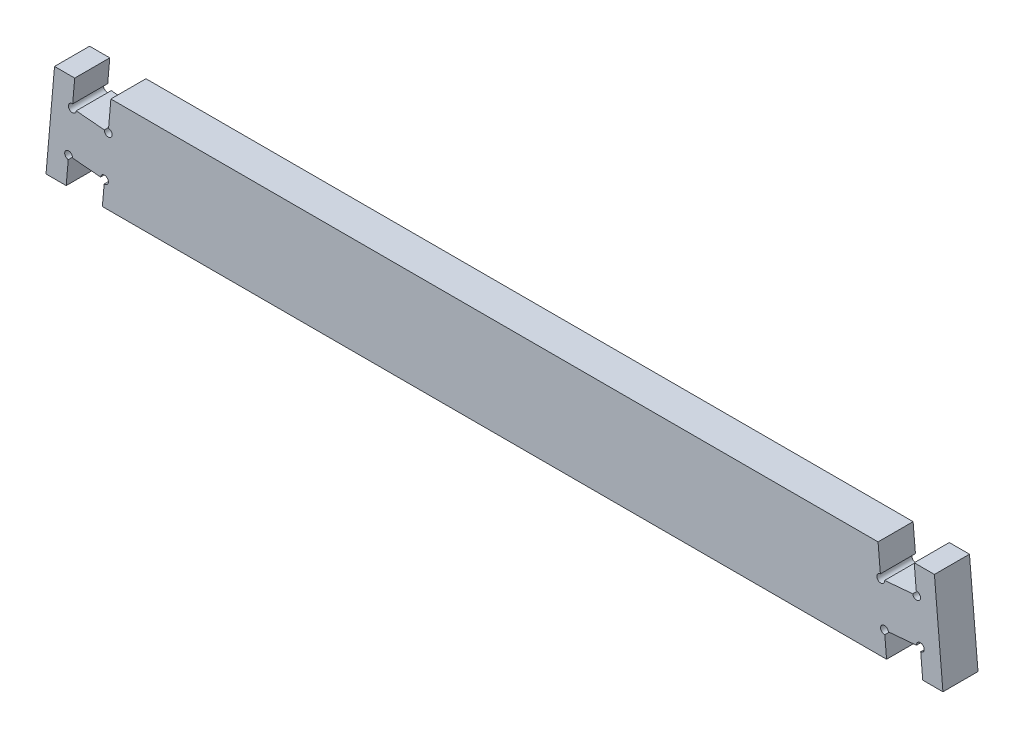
ISO-10303-21;
HEADER;
FILE_DESCRIPTION(('STEP AP214'),'2;1');
FILE_NAME('part.step','',(''),(''),'','','');
FILE_SCHEMA(('AUTOMOTIVE_DESIGN { 1 0 10303 214 1 1 1 1 }'));
ENDSEC;
DATA;
#1=APPLICATION_CONTEXT('core data for automotive mechanical design processes');
#2=APPLICATION_PROTOCOL_DEFINITION('international standard','automotive_design',2000,#1);
#3=PRODUCT_CONTEXT('',#1,'mechanical');
#4=PRODUCT('Part','Part','',(#3));
#5=PRODUCT_RELATED_PRODUCT_CATEGORY('part','',(#4));
#6=PRODUCT_DEFINITION_FORMATION('','',#4);
#7=PRODUCT_DEFINITION_CONTEXT('part definition',#1,'design');
#8=PRODUCT_DEFINITION('design','',#6,#7);
#9=PRODUCT_DEFINITION_SHAPE('','',#8);
#10=(LENGTH_UNIT() NAMED_UNIT(*) SI_UNIT(.MILLI.,.METRE.));
#11=(NAMED_UNIT(*) PLANE_ANGLE_UNIT() SI_UNIT($,.RADIAN.));
#12=(NAMED_UNIT(*) SI_UNIT($,.STERADIAN.) SOLID_ANGLE_UNIT());
#13=UNCERTAINTY_MEASURE_WITH_UNIT(LENGTH_MEASURE(1.E-05),#10,'distance_accuracy_value','');
#14=(GEOMETRIC_REPRESENTATION_CONTEXT(3) GLOBAL_UNCERTAINTY_ASSIGNED_CONTEXT((#13)) GLOBAL_UNIT_ASSIGNED_CONTEXT((#10,
#11,#12)) REPRESENTATION_CONTEXT('',''));
#15=CARTESIAN_POINT('',(0.,0.,0.));
#16=DIRECTION('',(0.,0.,1.));
#17=DIRECTION('',(1.,0.,0.));
#18=AXIS2_PLACEMENT_3D('',#15,#16,#17);
#19=CARTESIAN_POINT('',(-234.662804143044,-276.484369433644,18.));
#20=DIRECTION('',(-0.996194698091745,0.0871557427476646,0.));
#21=DIRECTION('',(-0.0871557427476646,-0.996194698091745,0.));
#22=AXIS2_PLACEMENT_3D('',#19,#20,#21);
#23=PLANE('',#22);
#24=DIRECTION('',(0.0871557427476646,0.996194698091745,0.));
#25=VECTOR('',#24,1.);
#26=CARTESIAN_POINT('',(-234.662804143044,-276.484369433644,18.));
#27=LINE('',#26,#25);
#28=CARTESIAN_POINT('',(-235.713333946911,-288.491980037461,18.));
#29=VERTEX_POINT('',#28);
#30=CARTESIAN_POINT('',(-234.662804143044,-276.484369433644,18.));
#31=VERTEX_POINT('',#30);
#32=EDGE_CURVE('E305',#29,#31,#27,.T.);
#33=ORIENTED_EDGE('',*,*,#32,.F.);
#34=DIRECTION('',(0.,0.,1.));
#35=VECTOR('',#34,1.);
#36=CARTESIAN_POINT('',(-235.713333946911,-288.491980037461,-0.001000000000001));
#37=LINE('',#36,#35);
#38=CARTESIAN_POINT('',(-235.713333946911,-288.491980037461,0.));
#39=VERTEX_POINT('',#38);
#40=EDGE_CURVE('E417',#39,#29,#37,.T.);
#41=ORIENTED_EDGE('',*,*,#40,.F.);
#42=DIRECTION('',(0.0871557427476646,0.996194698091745,0.));
#43=VECTOR('',#42,1.);
#44=CARTESIAN_POINT('',(-234.662804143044,-276.484369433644,0.));
#45=LINE('',#44,#43);
#46=CARTESIAN_POINT('',(-234.662804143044,-276.484369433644,0.));
#47=VERTEX_POINT('',#46);
#48=EDGE_CURVE('E258',#39,#47,#45,.T.);
#49=ORIENTED_EDGE('',*,*,#48,.T.);
#50=DIRECTION('',(0.,0.,-1.));
#51=VECTOR('',#50,1.);
#52=CARTESIAN_POINT('',(-234.662804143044,-276.484369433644,18.));
#53=LINE('',#52,#51);
#54=EDGE_CURVE('E11',#31,#47,#53,.T.);
#55=ORIENTED_EDGE('',*,*,#54,.F.);
#56=EDGE_LOOP('',(#33,#41,#49,#55));
#57=FACE_BOUND('',#56,.T.);
#58=ADVANCED_FACE('F33',(#57),#23,.F.);
#59=CARTESIAN_POINT('',(-234.662804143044,-276.484369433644,18.));
#60=DIRECTION('',(0.,-1.,0.));
#61=DIRECTION('',(1.,0.,0.));
#62=AXIS2_PLACEMENT_3D('',#59,#60,#61);
#63=PLANE('',#62);
#64=DIRECTION('',(-1.,0.,0.));
#65=VECTOR('',#64,1.);
#66=CARTESIAN_POINT('',(-234.662804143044,-276.484369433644,0.));
#67=LINE('',#66,#65);
#68=CARTESIAN_POINT('',(-245.022665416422,-276.484369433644,0.));
#69=VERTEX_POINT('',#68);
#70=EDGE_CURVE('E260',#47,#69,#67,.T.);
#71=ORIENTED_EDGE('',*,*,#70,.T.);
#72=DIRECTION('',(0.,0.,-1.));
#73=VECTOR('',#72,1.);
#74=CARTESIAN_POINT('',(-245.022665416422,-276.484369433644,18.));
#75=LINE('',#74,#73);
#76=CARTESIAN_POINT('',(-245.022665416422,-276.484369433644,18.));
#77=VERTEX_POINT('',#76);
#78=EDGE_CURVE('E40',#77,#69,#75,.T.);
#79=ORIENTED_EDGE('',*,*,#78,.F.);
#80=DIRECTION('',(-1.,0.,0.));
#81=VECTOR('',#80,1.);
#82=CARTESIAN_POINT('',(-234.662804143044,-276.484369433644,18.));
#83=LINE('',#82,#81);
#84=EDGE_CURVE('E410',#31,#77,#83,.T.);
#85=ORIENTED_EDGE('',*,*,#84,.F.);
#86=ORIENTED_EDGE('',*,*,#54,.T.);
#87=EDGE_LOOP('',(#71,#79,#85,#86));
#88=FACE_BOUND('',#87,.T.);
#89=ADVANCED_FACE('F414',(#88),#63,.F.);
#90=CARTESIAN_POINT('',(-245.022665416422,-276.484369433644,18.));
#91=DIRECTION('',(0.996194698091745,-0.0871557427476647,0.));
#92=DIRECTION('',(0.0871557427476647,0.996194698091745,0.));
#93=AXIS2_PLACEMENT_3D('',#90,#91,#92);
#94=PLANE('',#93);
#95=DIRECTION('',(-0.0871557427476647,-0.996194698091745,0.));
#96=VECTOR('',#95,1.);
#97=CARTESIAN_POINT('',(-245.022665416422,-276.484369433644,0.));
#98=LINE('',#97,#96);
#99=CARTESIAN_POINT('',(-249.397098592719,-326.484369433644,0.));
#100=VERTEX_POINT('',#99);
#101=EDGE_CURVE('E263',#69,#100,#98,.T.);
#102=ORIENTED_EDGE('',*,*,#101,.T.);
#103=DIRECTION('',(0.,0.,-1.));
#104=VECTOR('',#103,1.);
#105=CARTESIAN_POINT('',(-249.397098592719,-326.484369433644,18.));
#106=LINE('',#105,#104);
#107=CARTESIAN_POINT('',(-249.397098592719,-326.484369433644,18.));
#108=VERTEX_POINT('',#107);
#109=EDGE_CURVE('E332',#108,#100,#106,.T.);
#110=ORIENTED_EDGE('',*,*,#109,.F.);
#111=DIRECTION('',(-0.0871557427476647,-0.996194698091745,0.));
#112=VECTOR('',#111,1.);
#113=CARTESIAN_POINT('',(-245.022665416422,-276.484369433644,18.));
#114=LINE('',#113,#112);
#115=EDGE_CURVE('E341',#77,#108,#114,.T.);
#116=ORIENTED_EDGE('',*,*,#115,.F.);
#117=ORIENTED_EDGE('',*,*,#78,.T.);
#118=EDGE_LOOP('',(#102,#110,#116,#117));
#119=FACE_BOUND('',#118,.T.);
#120=ADVANCED_FACE('F339',(#119),#94,.F.);
#121=CARTESIAN_POINT('',(-249.397098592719,-326.484369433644,18.));
#122=DIRECTION('',(0.,1.,0.));
#123=DIRECTION('',(0.,0.,1.));
#124=AXIS2_PLACEMENT_3D('',#121,#122,#123);
#125=PLANE('',#124);
#126=DIRECTION('',(1.,0.,0.));
#127=VECTOR('',#126,1.);
#128=CARTESIAN_POINT('',(-249.397098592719,-326.484369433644,0.));
#129=LINE('',#128,#127);
#130=CARTESIAN_POINT('',(-239.03723731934,-326.484369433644,0.));
#131=VERTEX_POINT('',#130);
#132=EDGE_CURVE('E265',#100,#131,#129,.T.);
#133=ORIENTED_EDGE('',*,*,#132,.T.);
#134=DIRECTION('',(0.,0.,-1.));
#135=VECTOR('',#134,1.);
#136=CARTESIAN_POINT('',(-239.03723731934,-326.484369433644,18.));
#137=LINE('',#136,#135);
#138=CARTESIAN_POINT('',(-239.03723731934,-326.484369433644,18.));
#139=VERTEX_POINT('',#138);
#140=EDGE_CURVE('E329',#139,#131,#137,.T.);
#141=ORIENTED_EDGE('',*,*,#140,.F.);
#142=DIRECTION('',(1.,0.,0.));
#143=VECTOR('',#142,1.);
#144=CARTESIAN_POINT('',(-249.397098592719,-326.484369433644,18.));
#145=LINE('',#144,#143);
#146=EDGE_CURVE('E365',#108,#139,#145,.T.);
#147=ORIENTED_EDGE('',*,*,#146,.F.);
#148=ORIENTED_EDGE('',*,*,#109,.T.);
#149=EDGE_LOOP('',(#133,#141,#147,#148));
#150=FACE_BOUND('',#149,.T.);
#151=ADVANCED_FACE('F354',(#150),#125,.F.);
#152=CARTESIAN_POINT('',(-237.805071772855,-312.400652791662,18.));
#153=DIRECTION('',(-0.996194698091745,0.087155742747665,0.));
#154=DIRECTION('',(-0.087155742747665,-0.996194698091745,0.));
#155=AXIS2_PLACEMENT_3D('',#152,#153,#154);
#156=PLANE('',#155);
#157=DIRECTION('',(0.087155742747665,0.996194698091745,0.));
#158=VECTOR('',#157,1.);
#159=CARTESIAN_POINT('',(-237.805071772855,-312.400652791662,0.));
#160=LINE('',#159,#158);
#161=CARTESIAN_POINT('',(-237.979383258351,-314.393042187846,0.));
#162=VERTEX_POINT('',#161);
#163=EDGE_CURVE('E267',#131,#162,#160,.T.);
#164=ORIENTED_EDGE('',*,*,#163,.T.);
#165=DIRECTION('',(0.,0.,1.));
#166=VECTOR('',#165,1.);
#167=CARTESIAN_POINT('',(-237.979383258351,-314.393042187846,-0.001000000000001));
#168=LINE('',#167,#166);
#169=CARTESIAN_POINT('',(-237.979383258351,-314.393042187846,18.));
#170=VERTEX_POINT('',#169);
#171=EDGE_CURVE('E362',#170,#162,#168,.F.);
#172=ORIENTED_EDGE('',*,*,#171,.F.);
#173=DIRECTION('',(0.087155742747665,0.996194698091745,0.));
#174=VECTOR('',#173,1.);
#175=CARTESIAN_POINT('',(-237.805071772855,-312.400652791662,18.));
#176=LINE('',#175,#174);
#177=EDGE_CURVE('E361',#139,#170,#176,.T.);
#178=ORIENTED_EDGE('',*,*,#177,.F.);
#179=ORIENTED_EDGE('',*,*,#140,.T.);
#180=EDGE_LOOP('',(#164,#172,#178,#179));
#181=FACE_BOUND('',#180,.T.);
#182=ADVANCED_FACE('F358',(#181),#156,.F.);
#183=CARTESIAN_POINT('',(-237.805071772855,-312.400652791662,18.));
#184=DIRECTION('',(0.0871557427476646,0.996194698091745,0.));
#185=DIRECTION('',(-0.996194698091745,0.0871557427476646,0.));
#186=AXIS2_PLACEMENT_3D('',#183,#184,#185);
#187=PLANE('',#186);
#188=DIRECTION('',(0.996194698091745,-0.0871557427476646,0.));
#189=VECTOR('',#188,1.);
#190=CARTESIAN_POINT('',(-237.805071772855,-312.400652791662,0.));
#191=LINE('',#190,#189);
#192=CARTESIAN_POINT('',(-235.812682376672,-312.574964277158,0.));
#193=VERTEX_POINT('',#192);
#194=CARTESIAN_POINT('',(-221.367859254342,-313.838722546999,0.));
#195=VERTEX_POINT('',#194);
#196=EDGE_CURVE('E270',#193,#195,#191,.T.);
#197=ORIENTED_EDGE('',*,*,#196,.T.);
#198=DIRECTION('',(0.,0.,1.));
#199=VECTOR('',#198,1.);
#200=CARTESIAN_POINT('',(-221.367859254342,-313.838722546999,-0.001000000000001));
#201=LINE('',#200,#199);
#202=CARTESIAN_POINT('',(-221.367859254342,-313.838722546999,18.));
#203=VERTEX_POINT('',#202);
#204=EDGE_CURVE('E444',#203,#195,#201,.F.);
#205=ORIENTED_EDGE('',*,*,#204,.F.);
#206=DIRECTION('',(0.996194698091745,-0.0871557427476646,0.));
#207=VECTOR('',#206,1.);
#208=CARTESIAN_POINT('',(-237.805071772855,-312.400652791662,18.));
#209=LINE('',#208,#207);
#210=CARTESIAN_POINT('',(-235.812682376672,-312.574964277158,18.));
#211=VERTEX_POINT('',#210);
#212=EDGE_CURVE('E364',#211,#203,#209,.T.);
#213=ORIENTED_EDGE('',*,*,#212,.F.);
#214=DIRECTION('',(0.,0.,1.));
#215=VECTOR('',#214,1.);
#216=CARTESIAN_POINT('',(-235.812682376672,-312.574964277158,-0.001000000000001));
#217=LINE('',#216,#215);
#218=EDGE_CURVE('E451',#193,#211,#217,.T.);
#219=ORIENTED_EDGE('',*,*,#218,.F.);
#220=EDGE_LOOP('',(#197,#205,#213,#219));
#221=FACE_BOUND('',#220,.T.);
#222=ADVANCED_FACE('F461',(#221),#187,.F.);
#223=CARTESIAN_POINT('',(-219.375469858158,-314.013034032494,18.));
#224=DIRECTION('',(0.996194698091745,-0.0871557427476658,0.));
#225=DIRECTION('',(0.0871557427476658,0.996194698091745,0.));
#226=AXIS2_PLACEMENT_3D('',#223,#224,#225);
#227=PLANE('',#226);
#228=DIRECTION('',(-0.0871557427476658,-0.996194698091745,0.));
#229=VECTOR('',#228,1.);
#230=CARTESIAN_POINT('',(-219.375469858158,-314.013034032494,18.));
#231=LINE('',#230,#229);
#232=CARTESIAN_POINT('',(-219.549781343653,-316.005423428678,18.));
#233=VERTEX_POINT('',#232);
#234=CARTESIAN_POINT('',(-220.466570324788,-326.484369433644,18.));
#235=VERTEX_POINT('',#234);
#236=EDGE_CURVE('E368',#233,#235,#231,.T.);
#237=ORIENTED_EDGE('',*,*,#236,.F.);
#238=DIRECTION('',(0.,0.,1.));
#239=VECTOR('',#238,1.);
#240=CARTESIAN_POINT('',(-219.549781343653,-316.005423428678,-0.001000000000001));
#241=LINE('',#240,#239);
#242=CARTESIAN_POINT('',(-219.549781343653,-316.005423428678,0.));
#243=VERTEX_POINT('',#242);
#244=EDGE_CURVE('E420',#243,#233,#241,.T.);
#245=ORIENTED_EDGE('',*,*,#244,.F.);
#246=DIRECTION('',(-0.0871557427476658,-0.996194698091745,0.));
#247=VECTOR('',#246,1.);
#248=CARTESIAN_POINT('',(-219.375469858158,-314.013034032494,0.));
#249=LINE('',#248,#247);
#250=CARTESIAN_POINT('',(-220.466570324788,-326.484369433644,0.));
#251=VERTEX_POINT('',#250);
#252=EDGE_CURVE('E273',#243,#251,#249,.T.);
#253=ORIENTED_EDGE('',*,*,#252,.T.);
#254=DIRECTION('',(0.,0.,-1.));
#255=VECTOR('',#254,1.);
#256=CARTESIAN_POINT('',(-220.466570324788,-326.484369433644,18.));
#257=LINE('',#256,#255);
#258=EDGE_CURVE('E326',#235,#251,#257,.T.);
#259=ORIENTED_EDGE('',*,*,#258,.F.);
#260=EDGE_LOOP('',(#237,#245,#253,#259));
#261=FACE_BOUND('',#260,.T.);
#262=ADVANCED_FACE('F472',(#261),#227,.F.);
#263=CARTESIAN_POINT('',(182.063053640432,-326.484369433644,18.));
#264=DIRECTION('',(0.,1.,0.));
#265=DIRECTION('',(-1.,0.,0.));
#266=AXIS2_PLACEMENT_3D('',#263,#264,#265);
#267=PLANE('',#266);
#268=DIRECTION('',(1.,0.,0.));
#269=VECTOR('',#268,1.);
#270=CARTESIAN_POINT('',(182.063053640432,-326.484369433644,0.));
#271=LINE('',#270,#269);
#272=CARTESIAN_POINT('',(182.063053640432,-326.484369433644,0.));
#273=VERTEX_POINT('',#272);
#274=EDGE_CURVE('E275',#251,#273,#271,.T.);
#275=ORIENTED_EDGE('',*,*,#274,.T.);
#276=DIRECTION('',(0.,0.,-1.));
#277=VECTOR('',#276,1.);
#278=CARTESIAN_POINT('',(182.063053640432,-326.484369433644,18.));
#279=LINE('',#278,#277);
#280=CARTESIAN_POINT('',(182.063053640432,-326.484369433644,18.));
#281=VERTEX_POINT('',#280);
#282=EDGE_CURVE('E323',#281,#273,#279,.T.);
#283=ORIENTED_EDGE('',*,*,#282,.F.);
#284=DIRECTION('',(1.,0.,0.));
#285=VECTOR('',#284,1.);
#286=CARTESIAN_POINT('',(182.063053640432,-326.484369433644,18.));
#287=LINE('',#286,#285);
#288=EDGE_CURVE('E374',#235,#281,#287,.T.);
#289=ORIENTED_EDGE('',*,*,#288,.F.);
#290=ORIENTED_EDGE('',*,*,#258,.T.);
#291=EDGE_LOOP('',(#275,#283,#289,#290));
#292=FACE_BOUND('',#291,.T.);
#293=ADVANCED_FACE('F479',(#292),#267,.F.);
#294=CARTESIAN_POINT('',(180.971953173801,-314.013034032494,18.));
#295=DIRECTION('',(-0.996194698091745,-0.0871557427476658,0.));
#296=DIRECTION('',(0.0871557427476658,-0.996194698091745,0.));
#297=AXIS2_PLACEMENT_3D('',#294,#295,#296);
#298=PLANE('',#297);
#299=DIRECTION('',(-0.0871557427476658,0.996194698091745,0.));
#300=VECTOR('',#299,1.);
#301=CARTESIAN_POINT('',(180.971953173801,-314.013034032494,0.));
#302=LINE('',#301,#300);
#303=CARTESIAN_POINT('',(181.146264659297,-316.005423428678,0.));
#304=VERTEX_POINT('',#303);
#305=EDGE_CURVE('E277',#273,#304,#302,.T.);
#306=ORIENTED_EDGE('',*,*,#305,.T.);
#307=DIRECTION('',(0.,0.,1.));
#308=VECTOR('',#307,1.);
#309=CARTESIAN_POINT('',(181.146264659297,-316.005423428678,-0.001000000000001));
#310=LINE('',#309,#308);
#311=CARTESIAN_POINT('',(181.146264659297,-316.005423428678,18.));
#312=VERTEX_POINT('',#311);
#313=EDGE_CURVE('E484',#312,#304,#310,.F.);
#314=ORIENTED_EDGE('',*,*,#313,.F.);
#315=DIRECTION('',(-0.0871557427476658,0.996194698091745,0.));
#316=VECTOR('',#315,1.);
#317=CARTESIAN_POINT('',(180.971953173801,-314.013034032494,18.));
#318=LINE('',#317,#316);
#319=EDGE_CURVE('E376',#281,#312,#318,.T.);
#320=ORIENTED_EDGE('',*,*,#319,.F.);
#321=ORIENTED_EDGE('',*,*,#282,.T.);
#322=EDGE_LOOP('',(#306,#314,#320,#321));
#323=FACE_BOUND('',#322,.T.);
#324=ADVANCED_FACE('F483',(#323),#298,.F.);
#325=CARTESIAN_POINT('',(199.401555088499,-312.400652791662,18.));
#326=DIRECTION('',(-0.0871557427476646,0.996194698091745,0.));
#327=DIRECTION('',(-0.996194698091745,-0.0871557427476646,0.));
#328=AXIS2_PLACEMENT_3D('',#325,#326,#327);
#329=PLANE('',#328);
#330=DIRECTION('',(0.996194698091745,0.0871557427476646,0.));
#331=VECTOR('',#330,1.);
#332=CARTESIAN_POINT('',(199.401555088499,-312.400652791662,0.));
#333=LINE('',#332,#331);
#334=CARTESIAN_POINT('',(182.964342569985,-313.838722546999,0.));
#335=VERTEX_POINT('',#334);
#336=CARTESIAN_POINT('',(197.409165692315,-312.574964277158,0.));
#337=VERTEX_POINT('',#336);
#338=EDGE_CURVE('E280',#335,#337,#333,.T.);
#339=ORIENTED_EDGE('',*,*,#338,.T.);
#340=DIRECTION('',(0.,0.,1.));
#341=VECTOR('',#340,1.);
#342=CARTESIAN_POINT('',(197.409165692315,-312.574964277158,-0.001000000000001));
#343=LINE('',#342,#341);
#344=CARTESIAN_POINT('',(197.409165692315,-312.574964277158,18.));
#345=VERTEX_POINT('',#344);
#346=EDGE_CURVE('E495',#345,#337,#343,.F.);
#347=ORIENTED_EDGE('',*,*,#346,.F.);
#348=DIRECTION('',(0.996194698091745,0.0871557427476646,0.));
#349=VECTOR('',#348,1.);
#350=CARTESIAN_POINT('',(199.401555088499,-312.400652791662,18.));
#351=LINE('',#350,#349);
#352=CARTESIAN_POINT('',(182.964342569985,-313.838722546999,18.));
#353=VERTEX_POINT('',#352);
#354=EDGE_CURVE('E379',#353,#345,#351,.T.);
#355=ORIENTED_EDGE('',*,*,#354,.F.);
#356=DIRECTION('',(0.,0.,1.));
#357=VECTOR('',#356,1.);
#358=CARTESIAN_POINT('',(182.964342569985,-313.838722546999,-0.001000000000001));
#359=LINE('',#358,#357);
#360=EDGE_CURVE('E442',#335,#353,#359,.T.);
#361=ORIENTED_EDGE('',*,*,#360,.F.);
#362=EDGE_LOOP('',(#339,#347,#355,#361));
#363=FACE_BOUND('',#362,.T.);
#364=ADVANCED_FACE('F545',(#363),#329,.F.);
#365=CARTESIAN_POINT('',(199.401555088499,-312.400652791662,18.));
#366=DIRECTION('',(0.996194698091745,0.087155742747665,0.));
#367=DIRECTION('',(-0.087155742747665,0.996194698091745,0.));
#368=AXIS2_PLACEMENT_3D('',#365,#366,#367);
#369=PLANE('',#368);
#370=DIRECTION('',(0.087155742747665,-0.996194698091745,0.));
#371=VECTOR('',#370,1.);
#372=CARTESIAN_POINT('',(199.401555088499,-312.400652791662,18.));
#373=LINE('',#372,#371);
#374=CARTESIAN_POINT('',(199.575866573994,-314.393042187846,18.));
#375=VERTEX_POINT('',#374);
#376=CARTESIAN_POINT('',(200.633720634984,-326.484369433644,18.));
#377=VERTEX_POINT('',#376);
#378=EDGE_CURVE('E382',#375,#377,#373,.T.);
#379=ORIENTED_EDGE('',*,*,#378,.F.);
#380=DIRECTION('',(0.,0.,1.));
#381=VECTOR('',#380,1.);
#382=CARTESIAN_POINT('',(199.575866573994,-314.393042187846,-0.001000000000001));
#383=LINE('',#382,#381);
#384=CARTESIAN_POINT('',(199.575866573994,-314.393042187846,0.));
#385=VERTEX_POINT('',#384);
#386=EDGE_CURVE('E497',#385,#375,#383,.T.);
#387=ORIENTED_EDGE('',*,*,#386,.F.);
#388=DIRECTION('',(0.087155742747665,-0.996194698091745,0.));
#389=VECTOR('',#388,1.);
#390=CARTESIAN_POINT('',(199.401555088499,-312.400652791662,0.));
#391=LINE('',#390,#389);
#392=CARTESIAN_POINT('',(200.633720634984,-326.484369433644,0.));
#393=VERTEX_POINT('',#392);
#394=EDGE_CURVE('E283',#385,#393,#391,.T.);
#395=ORIENTED_EDGE('',*,*,#394,.T.);
#396=DIRECTION('',(0.,0.,-1.));
#397=VECTOR('',#396,1.);
#398=CARTESIAN_POINT('',(200.633720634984,-326.484369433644,18.));
#399=LINE('',#398,#397);
#400=EDGE_CURVE('E320',#377,#393,#399,.T.);
#401=ORIENTED_EDGE('',*,*,#400,.F.);
#402=EDGE_LOOP('',(#379,#387,#395,#401));
#403=FACE_BOUND('',#402,.T.);
#404=ADVANCED_FACE('F548',(#403),#369,.F.);
#405=CARTESIAN_POINT('',(210.993581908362,-326.484369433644,18.));
#406=DIRECTION('',(0.,1.,0.));
#407=DIRECTION('',(0.,0.,1.));
#408=AXIS2_PLACEMENT_3D('',#405,#406,#407);
#409=PLANE('',#408);
#410=DIRECTION('',(1.,0.,0.));
#411=VECTOR('',#410,1.);
#412=CARTESIAN_POINT('',(210.993581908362,-326.484369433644,0.));
#413=LINE('',#412,#411);
#414=CARTESIAN_POINT('',(210.993581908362,-326.484369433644,0.));
#415=VERTEX_POINT('',#414);
#416=EDGE_CURVE('E285',#393,#415,#413,.T.);
#417=ORIENTED_EDGE('',*,*,#416,.T.);
#418=DIRECTION('',(0.,0.,-1.));
#419=VECTOR('',#418,1.);
#420=CARTESIAN_POINT('',(210.993581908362,-326.484369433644,18.));
#421=LINE('',#420,#419);
#422=CARTESIAN_POINT('',(210.993581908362,-326.484369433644,18.));
#423=VERTEX_POINT('',#422);
#424=EDGE_CURVE('E317',#423,#415,#421,.T.);
#425=ORIENTED_EDGE('',*,*,#424,.F.);
#426=DIRECTION('',(1.,0.,0.));
#427=VECTOR('',#426,1.);
#428=CARTESIAN_POINT('',(210.993581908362,-326.484369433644,18.));
#429=LINE('',#428,#427);
#430=EDGE_CURVE('E384',#377,#423,#429,.T.);
#431=ORIENTED_EDGE('',*,*,#430,.F.);
#432=ORIENTED_EDGE('',*,*,#400,.T.);
#433=EDGE_LOOP('',(#417,#425,#431,#432));
#434=FACE_BOUND('',#433,.T.);
#435=ADVANCED_FACE('F552',(#434),#409,.F.);
#436=CARTESIAN_POINT('',(206.619148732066,-276.484369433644,18.));
#437=DIRECTION('',(-0.996194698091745,-0.0871557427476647,0.));
#438=DIRECTION('',(0.0871557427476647,-0.996194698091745,0.));
#439=AXIS2_PLACEMENT_3D('',#436,#437,#438);
#440=PLANE('',#439);
#441=DIRECTION('',(-0.0871557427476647,0.996194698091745,0.));
#442=VECTOR('',#441,1.);
#443=CARTESIAN_POINT('',(206.619148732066,-276.484369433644,0.));
#444=LINE('',#443,#442);
#445=CARTESIAN_POINT('',(206.619148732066,-276.484369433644,0.));
#446=VERTEX_POINT('',#445);
#447=EDGE_CURVE('E287',#415,#446,#444,.T.);
#448=ORIENTED_EDGE('',*,*,#447,.T.);
#449=DIRECTION('',(0.,0.,-1.));
#450=VECTOR('',#449,1.);
#451=CARTESIAN_POINT('',(206.619148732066,-276.484369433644,18.));
#452=LINE('',#451,#450);
#453=CARTESIAN_POINT('',(206.619148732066,-276.484369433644,18.));
#454=VERTEX_POINT('',#453);
#455=EDGE_CURVE('E314',#454,#446,#452,.T.);
#456=ORIENTED_EDGE('',*,*,#455,.F.);
#457=DIRECTION('',(-0.0871557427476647,0.996194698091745,0.));
#458=VECTOR('',#457,1.);
#459=CARTESIAN_POINT('',(206.619148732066,-276.484369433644,18.));
#460=LINE('',#459,#458);
#461=EDGE_CURVE('E386',#423,#454,#460,.T.);
#462=ORIENTED_EDGE('',*,*,#461,.F.);
#463=ORIENTED_EDGE('',*,*,#424,.T.);
#464=EDGE_LOOP('',(#448,#456,#462,#463));
#465=FACE_BOUND('',#464,.T.);
#466=ADVANCED_FACE('F556',(#465),#440,.F.);
#467=CARTESIAN_POINT('',(196.259287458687,-276.484369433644,18.));
#468=DIRECTION('',(0.,-1.,0.));
#469=DIRECTION('',(1.,0.,0.));
#470=AXIS2_PLACEMENT_3D('',#467,#468,#469);
#471=PLANE('',#470);
#472=DIRECTION('',(-1.,0.,0.));
#473=VECTOR('',#472,1.);
#474=CARTESIAN_POINT('',(196.259287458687,-276.484369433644,0.));
#475=LINE('',#474,#473);
#476=CARTESIAN_POINT('',(196.259287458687,-276.484369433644,0.));
#477=VERTEX_POINT('',#476);
#478=EDGE_CURVE('E289',#446,#477,#475,.T.);
#479=ORIENTED_EDGE('',*,*,#478,.T.);
#480=DIRECTION('',(0.,0.,-1.));
#481=VECTOR('',#480,1.);
#482=CARTESIAN_POINT('',(196.259287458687,-276.484369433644,18.));
#483=LINE('',#482,#481);
#484=CARTESIAN_POINT('',(196.259287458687,-276.484369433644,18.));
#485=VERTEX_POINT('',#484);
#486=EDGE_CURVE('E311',#485,#477,#483,.T.);
#487=ORIENTED_EDGE('',*,*,#486,.F.);
#488=DIRECTION('',(-1.,0.,0.));
#489=VECTOR('',#488,1.);
#490=CARTESIAN_POINT('',(196.259287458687,-276.484369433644,18.));
#491=LINE('',#490,#489);
#492=EDGE_CURVE('E246',#454,#485,#491,.T.);
#493=ORIENTED_EDGE('',*,*,#492,.F.);
#494=ORIENTED_EDGE('',*,*,#455,.T.);
#495=EDGE_LOOP('',(#479,#487,#493,#494));
#496=FACE_BOUND('',#495,.T.);
#497=ADVANCED_FACE('F393',(#496),#471,.F.);
#498=CARTESIAN_POINT('',(196.259287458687,-276.484369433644,18.));
#499=DIRECTION('',(0.996194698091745,0.0871557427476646,0.));
#500=DIRECTION('',(-0.0871557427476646,0.996194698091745,0.));
#501=AXIS2_PLACEMENT_3D('',#498,#499,#500);
#502=PLANE('',#501);
#503=DIRECTION('',(0.0871557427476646,-0.996194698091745,0.));
#504=VECTOR('',#503,1.);
#505=CARTESIAN_POINT('',(196.259287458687,-276.484369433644,0.));
#506=LINE('',#505,#504);
#507=CARTESIAN_POINT('',(197.309817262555,-288.49198003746,0.));
#508=VERTEX_POINT('',#507);
#509=EDGE_CURVE('E291',#477,#508,#506,.T.);
#510=ORIENTED_EDGE('',*,*,#509,.T.);
#511=DIRECTION('',(0.,0.,1.));
#512=VECTOR('',#511,1.);
#513=CARTESIAN_POINT('',(197.309817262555,-288.49198003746,-0.001000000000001));
#514=LINE('',#513,#512);
#515=CARTESIAN_POINT('',(197.309817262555,-288.49198003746,18.));
#516=VERTEX_POINT('',#515);
#517=EDGE_CURVE('E399',#516,#508,#514,.F.);
#518=ORIENTED_EDGE('',*,*,#517,.F.);
#519=DIRECTION('',(0.0871557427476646,-0.996194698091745,0.));
#520=VECTOR('',#519,1.);
#521=CARTESIAN_POINT('',(196.259287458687,-276.484369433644,18.));
#522=LINE('',#521,#520);
#523=EDGE_CURVE('E242',#485,#516,#522,.T.);
#524=ORIENTED_EDGE('',*,*,#523,.F.);
#525=ORIENTED_EDGE('',*,*,#486,.T.);
#526=EDGE_LOOP('',(#510,#518,#524,#525));
#527=FACE_BOUND('',#526,.T.);
#528=ADVANCED_FACE('F398',(#527),#502,.F.);
#529=CARTESIAN_POINT('',(197.48412874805,-290.484369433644,18.));
#530=DIRECTION('',(0.0871557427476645,-0.996194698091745,0.));
#531=DIRECTION('',(0.996194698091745,0.0871557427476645,0.));
#532=AXIS2_PLACEMENT_3D('',#529,#530,#531);
#533=PLANE('',#532);
#534=DIRECTION('',(-0.996194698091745,-0.0871557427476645,0.));
#535=VECTOR('',#534,1.);
#536=CARTESIAN_POINT('',(197.48412874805,-290.484369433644,0.));
#537=LINE('',#536,#535);
#538=CARTESIAN_POINT('',(195.491739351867,-290.658680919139,0.));
#539=VERTEX_POINT('',#538);
#540=CARTESIAN_POINT('',(181.046916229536,-291.92243918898,0.));
#541=VERTEX_POINT('',#540);
#542=EDGE_CURVE('E235',#539,#541,#537,.T.);
#543=ORIENTED_EDGE('',*,*,#542,.T.);
#544=DIRECTION('',(0.,0.,1.));
#545=VECTOR('',#544,1.);
#546=CARTESIAN_POINT('',(181.046916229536,-291.92243918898,-0.001000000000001));
#547=LINE('',#546,#545);
#548=CARTESIAN_POINT('',(181.046916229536,-291.92243918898,18.));
#549=VERTEX_POINT('',#548);
#550=EDGE_CURVE('E219',#549,#541,#547,.F.);
#551=ORIENTED_EDGE('',*,*,#550,.F.);
#552=DIRECTION('',(-0.996194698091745,-0.0871557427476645,0.));
#553=VECTOR('',#552,1.);
#554=CARTESIAN_POINT('',(197.48412874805,-290.484369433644,18.));
#555=LINE('',#554,#553);
#556=CARTESIAN_POINT('',(195.491739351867,-290.658680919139,18.));
#557=VERTEX_POINT('',#556);
#558=EDGE_CURVE('E233',#557,#549,#555,.T.);
#559=ORIENTED_EDGE('',*,*,#558,.F.);
#560=DIRECTION('',(0.,0.,1.));
#561=VECTOR('',#560,1.);
#562=CARTESIAN_POINT('',(195.491739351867,-290.658680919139,-0.001000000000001));
#563=LINE('',#562,#561);
#564=EDGE_CURVE('E402',#539,#557,#563,.T.);
#565=ORIENTED_EDGE('',*,*,#564,.F.);
#566=EDGE_LOOP('',(#543,#551,#559,#565));
#567=FACE_BOUND('',#566,.T.);
#568=ADVANCED_FACE('F231',(#567),#533,.F.);
#569=CARTESIAN_POINT('',(177.688620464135,-276.484369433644,18.));
#570=DIRECTION('',(-0.996194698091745,-0.0871557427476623,0.));
#571=DIRECTION('',(0.0871557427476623,-0.996194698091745,0.));
#572=AXIS2_PLACEMENT_3D('',#569,#570,#571);
#573=PLANE('',#572);
#574=DIRECTION('',(-0.0871557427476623,0.996194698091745,0.));
#575=VECTOR('',#574,1.);
#576=CARTESIAN_POINT('',(177.688620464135,-276.484369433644,18.));
#577=LINE('',#576,#575);
#578=CARTESIAN_POINT('',(178.880215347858,-290.104361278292,18.));
#579=VERTEX_POINT('',#578);
#580=CARTESIAN_POINT('',(177.688620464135,-276.484369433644,18.));
#581=VERTEX_POINT('',#580);
#582=EDGE_CURVE('E241',#579,#581,#577,.T.);
#583=ORIENTED_EDGE('',*,*,#582,.F.);
#584=DIRECTION('',(0.,0.,1.));
#585=VECTOR('',#584,1.);
#586=CARTESIAN_POINT('',(178.880215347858,-290.104361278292,-0.001000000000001));
#587=LINE('',#586,#585);
#588=CARTESIAN_POINT('',(178.880215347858,-290.104361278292,0.));
#589=VERTEX_POINT('',#588);
#590=EDGE_CURVE('E222',#589,#579,#587,.T.);
#591=ORIENTED_EDGE('',*,*,#590,.F.);
#592=DIRECTION('',(-0.0871557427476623,0.996194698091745,0.));
#593=VECTOR('',#592,1.);
#594=CARTESIAN_POINT('',(177.688620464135,-276.484369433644,0.));
#595=LINE('',#594,#593);
#596=CARTESIAN_POINT('',(177.688620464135,-276.484369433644,0.));
#597=VERTEX_POINT('',#596);
#598=EDGE_CURVE('E295',#589,#597,#595,.T.);
#599=ORIENTED_EDGE('',*,*,#598,.T.);
#600=DIRECTION('',(0.,0.,-1.));
#601=VECTOR('',#600,1.);
#602=CARTESIAN_POINT('',(177.688620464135,-276.484369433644,18.));
#603=LINE('',#602,#601);
#604=EDGE_CURVE('E308',#581,#597,#603,.T.);
#605=ORIENTED_EDGE('',*,*,#604,.F.);
#606=EDGE_LOOP('',(#583,#591,#599,#605));
#607=FACE_BOUND('',#606,.T.);
#608=ADVANCED_FACE('F501',(#607),#573,.F.);
#609=CARTESIAN_POINT('',(-216.092137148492,-276.484369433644,18.));
#610=DIRECTION('',(0.,-1.,0.));
#611=DIRECTION('',(1.,0.,0.));
#612=AXIS2_PLACEMENT_3D('',#609,#610,#611);
#613=PLANE('',#612);
#614=DIRECTION('',(-1.,0.,0.));
#615=VECTOR('',#614,1.);
#616=CARTESIAN_POINT('',(-216.092137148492,-276.484369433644,0.));
#617=LINE('',#616,#615);
#618=CARTESIAN_POINT('',(-216.092137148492,-276.484369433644,0.));
#619=VERTEX_POINT('',#618);
#620=EDGE_CURVE('E297',#597,#619,#617,.T.);
#621=ORIENTED_EDGE('',*,*,#620,.T.);
#622=DIRECTION('',(0.,0.,-1.));
#623=VECTOR('',#622,1.);
#624=CARTESIAN_POINT('',(-216.092137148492,-276.484369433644,18.));
#625=LINE('',#624,#623);
#626=CARTESIAN_POINT('',(-216.092137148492,-276.484369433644,18.));
#627=VERTEX_POINT('',#626);
#628=EDGE_CURVE('E257',#627,#619,#625,.T.);
#629=ORIENTED_EDGE('',*,*,#628,.F.);
#630=DIRECTION('',(-1.,0.,0.));
#631=VECTOR('',#630,1.);
#632=CARTESIAN_POINT('',(-216.092137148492,-276.484369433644,18.));
#633=LINE('',#632,#631);
#634=EDGE_CURVE('E244',#581,#627,#633,.T.);
#635=ORIENTED_EDGE('',*,*,#634,.F.);
#636=ORIENTED_EDGE('',*,*,#604,.T.);
#637=EDGE_LOOP('',(#621,#629,#635,#636));
#638=FACE_BOUND('',#637,.T.);
#639=ADVANCED_FACE('F507',(#638),#613,.F.);
#640=CARTESIAN_POINT('',(-216.092137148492,-276.484369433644,18.));
#641=DIRECTION('',(0.996194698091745,-0.0871557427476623,0.));
#642=DIRECTION('',(0.0871557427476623,0.996194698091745,0.));
#643=AXIS2_PLACEMENT_3D('',#640,#641,#642);
#644=PLANE('',#643);
#645=DIRECTION('',(-0.0871557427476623,-0.996194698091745,0.));
#646=VECTOR('',#645,1.);
#647=CARTESIAN_POINT('',(-216.092137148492,-276.484369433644,0.));
#648=LINE('',#647,#646);
#649=CARTESIAN_POINT('',(-217.283732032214,-290.104361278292,0.));
#650=VERTEX_POINT('',#649);
#651=EDGE_CURVE('E299',#619,#650,#648,.T.);
#652=ORIENTED_EDGE('',*,*,#651,.T.);
#653=DIRECTION('',(0.,0.,1.));
#654=VECTOR('',#653,1.);
#655=CARTESIAN_POINT('',(-217.283732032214,-290.104361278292,-0.001000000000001));
#656=LINE('',#655,#654);
#657=CARTESIAN_POINT('',(-217.283732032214,-290.104361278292,18.));
#658=VERTEX_POINT('',#657);
#659=EDGE_CURVE('E47',#658,#650,#656,.F.);
#660=ORIENTED_EDGE('',*,*,#659,.F.);
#661=DIRECTION('',(-0.0871557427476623,-0.996194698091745,0.));
#662=VECTOR('',#661,1.);
#663=CARTESIAN_POINT('',(-216.092137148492,-276.484369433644,18.));
#664=LINE('',#663,#662);
#665=EDGE_CURVE('E251',#627,#658,#664,.T.);
#666=ORIENTED_EDGE('',*,*,#665,.F.);
#667=ORIENTED_EDGE('',*,*,#628,.T.);
#668=EDGE_LOOP('',(#652,#660,#666,#667));
#669=FACE_BOUND('',#668,.T.);
#670=ADVANCED_FACE('F511',(#669),#644,.F.);
#671=CARTESIAN_POINT('',(-235.887645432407,-290.484369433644,18.));
#672=DIRECTION('',(-0.0871557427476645,-0.996194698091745,0.));
#673=DIRECTION('',(0.996194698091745,-0.0871557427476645,0.));
#674=AXIS2_PLACEMENT_3D('',#671,#672,#673);
#675=PLANE('',#674);
#676=DIRECTION('',(-0.996194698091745,0.0871557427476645,0.));
#677=VECTOR('',#676,1.);
#678=CARTESIAN_POINT('',(-235.887645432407,-290.484369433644,18.));
#679=LINE('',#678,#677);
#680=CARTESIAN_POINT('',(-219.450432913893,-291.92243918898,18.));
#681=VERTEX_POINT('',#680);
#682=CARTESIAN_POINT('',(-233.895256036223,-290.658680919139,18.));
#683=VERTEX_POINT('',#682);
#684=EDGE_CURVE('E254',#681,#683,#679,.T.);
#685=ORIENTED_EDGE('',*,*,#684,.F.);
#686=DIRECTION('',(0.,0.,1.));
#687=VECTOR('',#686,1.);
#688=CARTESIAN_POINT('',(-219.450432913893,-291.92243918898,-0.001000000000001));
#689=LINE('',#688,#687);
#690=CARTESIAN_POINT('',(-219.450432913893,-291.92243918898,0.));
#691=VERTEX_POINT('',#690);
#692=EDGE_CURVE('E427',#691,#681,#689,.T.);
#693=ORIENTED_EDGE('',*,*,#692,.F.);
#694=DIRECTION('',(-0.996194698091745,0.0871557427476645,0.));
#695=VECTOR('',#694,1.);
#696=CARTESIAN_POINT('',(-235.887645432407,-290.484369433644,0.));
#697=LINE('',#696,#695);
#698=CARTESIAN_POINT('',(-233.895256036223,-290.658680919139,0.));
#699=VERTEX_POINT('',#698);
#700=EDGE_CURVE('E302',#691,#699,#697,.T.);
#701=ORIENTED_EDGE('',*,*,#700,.T.);
#702=DIRECTION('',(0.,0.,1.));
#703=VECTOR('',#702,1.);
#704=CARTESIAN_POINT('',(-233.895256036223,-290.658680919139,-0.001000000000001));
#705=LINE('',#704,#703);
#706=EDGE_CURVE('E55',#683,#699,#705,.F.);
#707=ORIENTED_EDGE('',*,*,#706,.F.);
#708=EDGE_LOOP('',(#685,#693,#701,#707));
#709=FACE_BOUND('',#708,.T.);
#710=ADVANCED_FACE('F426',(#709),#675,.F.);
#711=CARTESIAN_POINT('',(0.,0.,18.));
#712=DIRECTION('',(0.,0.,1.));
#713=DIRECTION('',(1.,0.,0.));
#714=AXIS2_PLACEMENT_3D('',#711,#712,#713);
#715=PLANE('',#714);
#716=CARTESIAN_POINT('',(179.054526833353,-292.096750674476,18.));
#717=DIRECTION('',(0.,0.,1.));
#718=DIRECTION('',(1.,0.,0.));
#719=AXIS2_PLACEMENT_3D('',#716,#717,#718);
#720=CIRCLE('',#719,2.);
#721=EDGE_CURVE('E216',#579,#549,#720,.T.);
#722=ORIENTED_EDGE('',*,*,#721,.F.);
#723=ORIENTED_EDGE('',*,*,#582,.T.);
#724=ORIENTED_EDGE('',*,*,#634,.T.);
#725=ORIENTED_EDGE('',*,*,#665,.T.);
#726=CARTESIAN_POINT('',(-217.458043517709,-292.096750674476,18.));
#727=DIRECTION('',(0.,0.,1.));
#728=DIRECTION('',(1.,0.,0.));
#729=AXIS2_PLACEMENT_3D('',#726,#727,#728);
#730=CIRCLE('',#729,2.);
#731=EDGE_CURVE('E431',#681,#658,#730,.T.);
#732=ORIENTED_EDGE('',*,*,#731,.F.);
#733=ORIENTED_EDGE('',*,*,#684,.T.);
#734=CARTESIAN_POINT('',(-235.887645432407,-290.484369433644,18.));
#735=DIRECTION('',(0.,0.,1.));
#736=DIRECTION('',(1.,0.,0.));
#737=AXIS2_PLACEMENT_3D('',#734,#735,#736);
#738=CIRCLE('',#737,2.);
#739=EDGE_CURVE('E421',#29,#683,#738,.T.);
#740=ORIENTED_EDGE('',*,*,#739,.F.);
#741=ORIENTED_EDGE('',*,*,#32,.T.);
#742=ORIENTED_EDGE('',*,*,#84,.T.);
#743=ORIENTED_EDGE('',*,*,#115,.T.);
#744=ORIENTED_EDGE('',*,*,#146,.T.);
#745=ORIENTED_EDGE('',*,*,#177,.T.);
#746=CARTESIAN_POINT('',(-237.805071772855,-312.400652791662,18.));
#747=DIRECTION('',(0.,0.,1.));
#748=DIRECTION('',(1.,0.,0.));
#749=AXIS2_PLACEMENT_3D('',#746,#747,#748);
#750=CIRCLE('',#749,2.);
#751=EDGE_CURVE('E454',#211,#170,#750,.T.);
#752=ORIENTED_EDGE('',*,*,#751,.F.);
#753=ORIENTED_EDGE('',*,*,#212,.T.);
#754=CARTESIAN_POINT('',(-219.375469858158,-314.013034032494,18.));
#755=DIRECTION('',(0.,0.,1.));
#756=DIRECTION('',(1.,0.,0.));
#757=AXIS2_PLACEMENT_3D('',#754,#755,#756);
#758=CIRCLE('',#757,2.);
#759=EDGE_CURVE('E433',#233,#203,#758,.T.);
#760=ORIENTED_EDGE('',*,*,#759,.F.);
#761=ORIENTED_EDGE('',*,*,#236,.T.);
#762=ORIENTED_EDGE('',*,*,#288,.T.);
#763=ORIENTED_EDGE('',*,*,#319,.T.);
#764=CARTESIAN_POINT('',(180.971953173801,-314.013034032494,18.));
#765=DIRECTION('',(0.,0.,1.));
#766=DIRECTION('',(1.,0.,0.));
#767=AXIS2_PLACEMENT_3D('',#764,#765,#766);
#768=CIRCLE('',#767,2.);
#769=EDGE_CURVE('E487',#353,#312,#768,.T.);
#770=ORIENTED_EDGE('',*,*,#769,.F.);
#771=ORIENTED_EDGE('',*,*,#354,.T.);
#772=CARTESIAN_POINT('',(199.401555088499,-312.400652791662,18.));
#773=DIRECTION('',(0.,0.,1.));
#774=DIRECTION('',(1.,0.,0.));
#775=AXIS2_PLACEMENT_3D('',#772,#773,#774);
#776=CIRCLE('',#775,2.);
#777=EDGE_CURVE('E493',#375,#345,#776,.T.);
#778=ORIENTED_EDGE('',*,*,#777,.F.);
#779=ORIENTED_EDGE('',*,*,#378,.T.);
#780=ORIENTED_EDGE('',*,*,#430,.T.);
#781=ORIENTED_EDGE('',*,*,#461,.T.);
#782=ORIENTED_EDGE('',*,*,#492,.T.);
#783=ORIENTED_EDGE('',*,*,#523,.T.);
#784=CARTESIAN_POINT('',(197.48412874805,-290.484369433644,18.));
#785=DIRECTION('',(0.,0.,1.));
#786=DIRECTION('',(1.,0.,0.));
#787=AXIS2_PLACEMENT_3D('',#784,#785,#786);
#788=CIRCLE('',#787,2.);
#789=EDGE_CURVE('E240',#557,#516,#788,.T.);
#790=ORIENTED_EDGE('',*,*,#789,.F.);
#791=ORIENTED_EDGE('',*,*,#558,.T.);
#792=EDGE_LOOP('',(#722,#723,#724,#725,#732,#733,#740,#741,#742,#743,#744,#745,#752,#753,#760,
#761,#762,#763,#770,#771,#778,#779,#780,#781,#782,#783,#790,#791));
#793=FACE_BOUND('',#792,.T.);
#794=ADVANCED_FACE('F238',(#793),#715,.T.);
#795=CARTESIAN_POINT('',(0.,0.,0.));
#796=DIRECTION('',(0.,0.,1.));
#797=DIRECTION('',(1.,0.,0.));
#798=AXIS2_PLACEMENT_3D('',#795,#796,#797);
#799=PLANE('',#798);
#800=ORIENTED_EDGE('',*,*,#598,.F.);
#801=CARTESIAN_POINT('',(179.054526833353,-292.096750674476,0.));
#802=DIRECTION('',(0.,0.,1.));
#803=DIRECTION('',(1.,0.,0.));
#804=AXIS2_PLACEMENT_3D('',#801,#802,#803);
#805=CIRCLE('',#804,2.);
#806=EDGE_CURVE('E226',#541,#589,#805,.F.);
#807=ORIENTED_EDGE('',*,*,#806,.F.);
#808=ORIENTED_EDGE('',*,*,#542,.F.);
#809=CARTESIAN_POINT('',(197.48412874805,-290.484369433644,0.));
#810=DIRECTION('',(0.,0.,1.));
#811=DIRECTION('',(1.,0.,0.));
#812=AXIS2_PLACEMENT_3D('',#809,#810,#811);
#813=CIRCLE('',#812,2.);
#814=EDGE_CURVE('E261',#508,#539,#813,.F.);
#815=ORIENTED_EDGE('',*,*,#814,.F.);
#816=ORIENTED_EDGE('',*,*,#509,.F.);
#817=ORIENTED_EDGE('',*,*,#478,.F.);
#818=ORIENTED_EDGE('',*,*,#447,.F.);
#819=ORIENTED_EDGE('',*,*,#416,.F.);
#820=ORIENTED_EDGE('',*,*,#394,.F.);
#821=CARTESIAN_POINT('',(199.401555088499,-312.400652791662,0.));
#822=DIRECTION('',(0.,0.,1.));
#823=DIRECTION('',(1.,0.,0.));
#824=AXIS2_PLACEMENT_3D('',#821,#822,#823);
#825=CIRCLE('',#824,2.);
#826=EDGE_CURVE('E491',#337,#385,#825,.F.);
#827=ORIENTED_EDGE('',*,*,#826,.F.);
#828=ORIENTED_EDGE('',*,*,#338,.F.);
#829=CARTESIAN_POINT('',(180.971953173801,-314.013034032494,0.));
#830=DIRECTION('',(0.,0.,1.));
#831=DIRECTION('',(1.,0.,0.));
#832=AXIS2_PLACEMENT_3D('',#829,#830,#831);
#833=CIRCLE('',#832,2.);
#834=EDGE_CURVE('E436',#304,#335,#833,.F.);
#835=ORIENTED_EDGE('',*,*,#834,.F.);
#836=ORIENTED_EDGE('',*,*,#305,.F.);
#837=ORIENTED_EDGE('',*,*,#274,.F.);
#838=ORIENTED_EDGE('',*,*,#252,.F.);
#839=CARTESIAN_POINT('',(-219.375469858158,-314.013034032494,0.));
#840=DIRECTION('',(0.,0.,1.));
#841=DIRECTION('',(1.,0.,0.));
#842=AXIS2_PLACEMENT_3D('',#839,#840,#841);
#843=CIRCLE('',#842,2.);
#844=EDGE_CURVE('E429',#195,#243,#843,.F.);
#845=ORIENTED_EDGE('',*,*,#844,.F.);
#846=ORIENTED_EDGE('',*,*,#196,.F.);
#847=CARTESIAN_POINT('',(-237.805071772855,-312.400652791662,0.));
#848=DIRECTION('',(0.,0.,1.));
#849=DIRECTION('',(1.,0.,0.));
#850=AXIS2_PLACEMENT_3D('',#847,#848,#849);
#851=CIRCLE('',#850,2.);
#852=EDGE_CURVE('E448',#162,#193,#851,.F.);
#853=ORIENTED_EDGE('',*,*,#852,.F.);
#854=ORIENTED_EDGE('',*,*,#163,.F.);
#855=ORIENTED_EDGE('',*,*,#132,.F.);
#856=ORIENTED_EDGE('',*,*,#101,.F.);
#857=ORIENTED_EDGE('',*,*,#70,.F.);
#858=ORIENTED_EDGE('',*,*,#48,.F.);
#859=CARTESIAN_POINT('',(-235.887645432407,-290.484369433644,0.));
#860=DIRECTION('',(0.,0.,1.));
#861=DIRECTION('',(1.,0.,0.));
#862=AXIS2_PLACEMENT_3D('',#859,#860,#861);
#863=CIRCLE('',#862,2.);
#864=EDGE_CURVE('E419',#699,#39,#863,.F.);
#865=ORIENTED_EDGE('',*,*,#864,.F.);
#866=ORIENTED_EDGE('',*,*,#700,.F.);
#867=CARTESIAN_POINT('',(-217.458043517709,-292.096750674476,0.));
#868=DIRECTION('',(0.,0.,1.));
#869=DIRECTION('',(1.,0.,0.));
#870=AXIS2_PLACEMENT_3D('',#867,#868,#869);
#871=CIRCLE('',#870,2.);
#872=EDGE_CURVE('E440',#650,#691,#871,.F.);
#873=ORIENTED_EDGE('',*,*,#872,.F.);
#874=ORIENTED_EDGE('',*,*,#651,.F.);
#875=ORIENTED_EDGE('',*,*,#620,.F.);
#876=EDGE_LOOP('',(#800,#807,#808,#815,#816,#817,#818,#819,#820,#827,#828,#835,#836,#837,#838,
#845,#846,#853,#854,#855,#856,#857,#858,#865,#866,#873,#874,#875));
#877=FACE_BOUND('',#876,.T.);
#878=ADVANCED_FACE('F348',(#877),#799,.F.);
#879=CARTESIAN_POINT('',(197.48412874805,-290.484369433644,-0.001000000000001));
#880=DIRECTION('',(0.,0.,1.));
#881=DIRECTION('',(1.,0.,0.));
#882=AXIS2_PLACEMENT_3D('',#879,#880,#881);
#883=CYLINDRICAL_SURFACE('',#882,2.);
#884=ORIENTED_EDGE('',*,*,#517,.T.);
#885=ORIENTED_EDGE('',*,*,#814,.T.);
#886=ORIENTED_EDGE('',*,*,#564,.T.);
#887=ORIENTED_EDGE('',*,*,#789,.T.);
#888=EDGE_LOOP('',(#884,#885,#886,#887));
#889=FACE_BOUND('',#888,.T.);
#890=ADVANCED_FACE('F577',(#889),#883,.F.);
#891=CARTESIAN_POINT('',(-237.805071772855,-312.400652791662,-0.001000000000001));
#892=DIRECTION('',(0.,0.,1.));
#893=DIRECTION('',(1.,0.,0.));
#894=AXIS2_PLACEMENT_3D('',#891,#892,#893);
#895=CYLINDRICAL_SURFACE('',#894,2.);
#896=ORIENTED_EDGE('',*,*,#171,.T.);
#897=ORIENTED_EDGE('',*,*,#852,.T.);
#898=ORIENTED_EDGE('',*,*,#218,.T.);
#899=ORIENTED_EDGE('',*,*,#751,.T.);
#900=EDGE_LOOP('',(#896,#897,#898,#899));
#901=FACE_BOUND('',#900,.T.);
#902=ADVANCED_FACE('F457',(#901),#895,.F.);
#903=CARTESIAN_POINT('',(-235.887645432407,-290.484369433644,-0.001000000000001));
#904=DIRECTION('',(0.,0.,1.));
#905=DIRECTION('',(1.,0.,0.));
#906=AXIS2_PLACEMENT_3D('',#903,#904,#905);
#907=CYLINDRICAL_SURFACE('',#906,2.);
#908=ORIENTED_EDGE('',*,*,#40,.T.);
#909=ORIENTED_EDGE('',*,*,#739,.T.);
#910=ORIENTED_EDGE('',*,*,#706,.T.);
#911=ORIENTED_EDGE('',*,*,#864,.T.);
#912=EDGE_LOOP('',(#908,#909,#910,#911));
#913=FACE_BOUND('',#912,.T.);
#914=ADVANCED_FACE('F522',(#913),#907,.F.);
#915=CARTESIAN_POINT('',(-219.375469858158,-314.013034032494,-0.001000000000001));
#916=DIRECTION('',(0.,0.,1.));
#917=DIRECTION('',(1.,0.,0.));
#918=AXIS2_PLACEMENT_3D('',#915,#916,#917);
#919=CYLINDRICAL_SURFACE('',#918,2.);
#920=ORIENTED_EDGE('',*,*,#204,.T.);
#921=ORIENTED_EDGE('',*,*,#844,.T.);
#922=ORIENTED_EDGE('',*,*,#244,.T.);
#923=ORIENTED_EDGE('',*,*,#759,.T.);
#924=EDGE_LOOP('',(#920,#921,#922,#923));
#925=FACE_BOUND('',#924,.T.);
#926=ADVANCED_FACE('F468',(#925),#919,.F.);
#927=CARTESIAN_POINT('',(-217.458043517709,-292.096750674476,-0.001000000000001));
#928=DIRECTION('',(0.,0.,1.));
#929=DIRECTION('',(1.,0.,0.));
#930=AXIS2_PLACEMENT_3D('',#927,#928,#929);
#931=CYLINDRICAL_SURFACE('',#930,2.);
#932=ORIENTED_EDGE('',*,*,#659,.T.);
#933=ORIENTED_EDGE('',*,*,#872,.T.);
#934=ORIENTED_EDGE('',*,*,#692,.T.);
#935=ORIENTED_EDGE('',*,*,#731,.T.);
#936=EDGE_LOOP('',(#932,#933,#934,#935));
#937=FACE_BOUND('',#936,.T.);
#938=ADVANCED_FACE('F512',(#937),#931,.F.);
#939=CARTESIAN_POINT('',(180.971953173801,-314.013034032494,-0.001000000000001));
#940=DIRECTION('',(0.,0.,1.));
#941=DIRECTION('',(1.,0.,0.));
#942=AXIS2_PLACEMENT_3D('',#939,#940,#941);
#943=CYLINDRICAL_SURFACE('',#942,2.);
#944=ORIENTED_EDGE('',*,*,#313,.T.);
#945=ORIENTED_EDGE('',*,*,#834,.T.);
#946=ORIENTED_EDGE('',*,*,#360,.T.);
#947=ORIENTED_EDGE('',*,*,#769,.T.);
#948=EDGE_LOOP('',(#944,#945,#946,#947));
#949=FACE_BOUND('',#948,.T.);
#950=ADVANCED_FACE('F514',(#949),#943,.F.);
#951=CARTESIAN_POINT('',(199.401555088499,-312.400652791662,-0.001000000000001));
#952=DIRECTION('',(0.,0.,1.));
#953=DIRECTION('',(1.,0.,0.));
#954=AXIS2_PLACEMENT_3D('',#951,#952,#953);
#955=CYLINDRICAL_SURFACE('',#954,2.);
#956=ORIENTED_EDGE('',*,*,#346,.T.);
#957=ORIENTED_EDGE('',*,*,#826,.T.);
#958=ORIENTED_EDGE('',*,*,#386,.T.);
#959=ORIENTED_EDGE('',*,*,#777,.T.);
#960=EDGE_LOOP('',(#956,#957,#958,#959));
#961=FACE_BOUND('',#960,.T.);
#962=ADVANCED_FACE('F520',(#961),#955,.F.);
#963=CARTESIAN_POINT('',(179.054526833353,-292.096750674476,-0.001000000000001));
#964=DIRECTION('',(0.,0.,1.));
#965=DIRECTION('',(1.,0.,0.));
#966=AXIS2_PLACEMENT_3D('',#963,#964,#965);
#967=CYLINDRICAL_SURFACE('',#966,2.);
#968=ORIENTED_EDGE('',*,*,#550,.T.);
#969=ORIENTED_EDGE('',*,*,#806,.T.);
#970=ORIENTED_EDGE('',*,*,#590,.T.);
#971=ORIENTED_EDGE('',*,*,#721,.T.);
#972=EDGE_LOOP('',(#968,#969,#970,#971));
#973=FACE_BOUND('',#972,.T.);
#974=ADVANCED_FACE('F218',(#973),#967,.F.);
#975=CLOSED_SHELL('',(#58,#89,#120,#151,#182,#222,#262,#293,#324,#364,#404,#435,#466,#497,#528,
#568,#608,#639,#670,#710,#794,#878,#890,#902,#914,#926,#938,#950,#962,#974));
#976=MANIFOLD_SOLID_BREP('B2',#975);
#977=ADVANCED_BREP_SHAPE_REPRESENTATION('',(#18,#976),#14);
#978=SHAPE_DEFINITION_REPRESENTATION(#9,#977);
ENDSEC;
END-ISO-10303-21;
